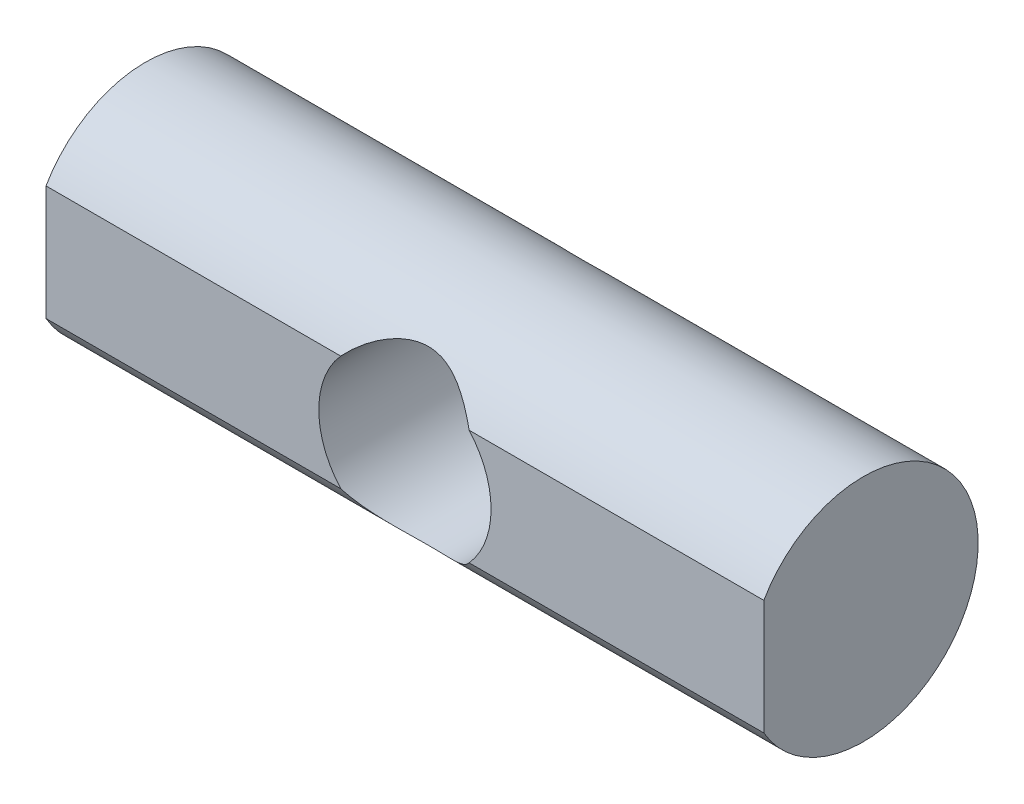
from build123d import *
from build123d.topology import SkipClean

# Parameters (mm, degrees)
BOSS_EXTRUDE1_DEPTH = 25
SKETCH2_R           = 6
CUT_EXTRUDE1_DEPTH  = 31.196874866


with BuildPart() as part:
    # Sketch1 → Boss-Extrude1 (new, symmetric)
    with BuildSketch(Plane(origin=(0, 0, 0), x_dir=(0, 0, -1), z_dir=(1, 0, 0))):
        with BuildLine():
            ThreePointArc((8, 0), (2.070552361, 7.72740661), (-6.92820323, 4))
            Line((-6.92820323, 4), (-6.92820323, -4))
            ThreePointArc((-6.92820323, -4), (2.070552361, -7.72740661), (8, 0))
        make_face()
    extrude(amount=BOSS_EXTRUDE1_DEPTH, both=True)

    # Sketch2 → Cut-Extrude1 (cut, through all)
    with SkipClean():  # the faces are left unmerged after this step: merging them gives an invalid solid
        with BuildSketch(Plane.XY.offset(6.92820323)):
            Circle(SKETCH2_R)
        extrude(amount=-CUT_EXTRUDE1_DEPTH, mode=Mode.SUBTRACT)


solid = part.part
